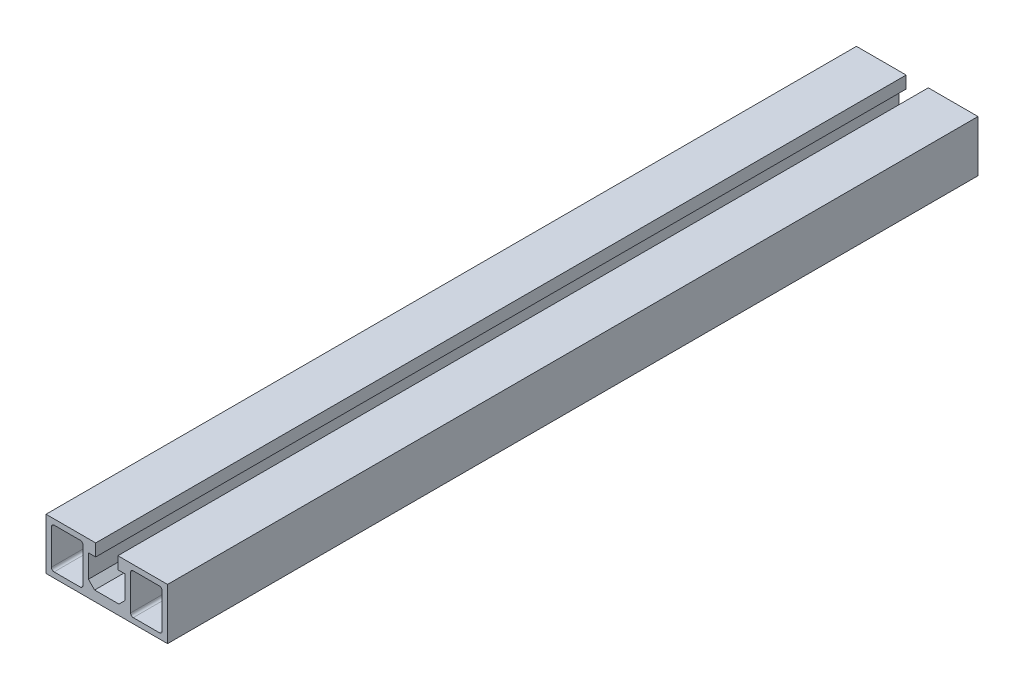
ISO-10303-21;
HEADER;
FILE_DESCRIPTION(('STEP AP214'),'2;1');
FILE_NAME('part.step','',(''),(''),'','','');
FILE_SCHEMA(('AUTOMOTIVE_DESIGN { 1 0 10303 214 1 1 1 1 }'));
ENDSEC;
DATA;
#1=APPLICATION_CONTEXT('core data for automotive mechanical design processes');
#2=APPLICATION_PROTOCOL_DEFINITION('international standard','automotive_design',2000,#1);
#3=PRODUCT_CONTEXT('',#1,'mechanical');
#4=PRODUCT('Part','Part','',(#3));
#5=PRODUCT_RELATED_PRODUCT_CATEGORY('part','',(#4));
#6=PRODUCT_DEFINITION_FORMATION('','',#4);
#7=PRODUCT_DEFINITION_CONTEXT('part definition',#1,'design');
#8=PRODUCT_DEFINITION('design','',#6,#7);
#9=PRODUCT_DEFINITION_SHAPE('','',#8);
#10=(LENGTH_UNIT() NAMED_UNIT(*) SI_UNIT(.MILLI.,.METRE.));
#11=(NAMED_UNIT(*) PLANE_ANGLE_UNIT() SI_UNIT($,.RADIAN.));
#12=(NAMED_UNIT(*) SI_UNIT($,.STERADIAN.) SOLID_ANGLE_UNIT());
#13=UNCERTAINTY_MEASURE_WITH_UNIT(LENGTH_MEASURE(1.E-05),#10,'distance_accuracy_value','');
#14=(GEOMETRIC_REPRESENTATION_CONTEXT(3) GLOBAL_UNCERTAINTY_ASSIGNED_CONTEXT((#13)) GLOBAL_UNIT_ASSIGNED_CONTEXT((#10,
#11,#12)) REPRESENTATION_CONTEXT('',''));
#15=CARTESIAN_POINT('',(0.,0.,0.));
#16=DIRECTION('',(0.,0.,1.));
#17=DIRECTION('',(1.,0.,0.));
#18=AXIS2_PLACEMENT_3D('',#15,#16,#17);
#19=CARTESIAN_POINT('',(-4.09999999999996,9.50000000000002,-150.));
#20=DIRECTION('',(0.,1.,0.));
#21=DIRECTION('',(-1.,0.,0.));
#22=AXIS2_PLACEMENT_3D('',#19,#20,#21);
#23=PLANE('',#22);
#24=DIRECTION('',(0.,0.,1.));
#25=VECTOR('',#24,1.);
#26=CARTESIAN_POINT('',(-22.5,9.50000000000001,-150.));
#27=LINE('',#26,#25);
#28=CARTESIAN_POINT('',(-22.5,9.50000000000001,-150.));
#29=VERTEX_POINT('',#28);
#30=CARTESIAN_POINT('',(-22.5,9.50000000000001,150.));
#31=VERTEX_POINT('',#30);
#32=EDGE_CURVE('E33',#29,#31,#27,.T.);
#33=ORIENTED_EDGE('',*,*,#32,.T.);
#34=DIRECTION('',(-1.,0.,0.));
#35=VECTOR('',#34,1.);
#36=CARTESIAN_POINT('',(-4.09999999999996,9.50000000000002,150.));
#37=LINE('',#36,#35);
#38=CARTESIAN_POINT('',(-4.09999999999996,9.50000000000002,150.));
#39=VERTEX_POINT('',#38);
#40=EDGE_CURVE('E294',#39,#31,#37,.T.);
#41=ORIENTED_EDGE('',*,*,#40,.F.);
#42=DIRECTION('',(0.,0.,1.));
#43=VECTOR('',#42,1.);
#44=CARTESIAN_POINT('',(-4.09999999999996,9.50000000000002,-150.));
#45=LINE('',#44,#43);
#46=CARTESIAN_POINT('',(-4.09999999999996,9.50000000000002,-150.));
#47=VERTEX_POINT('',#46);
#48=EDGE_CURVE('E11',#47,#39,#45,.T.);
#49=ORIENTED_EDGE('',*,*,#48,.F.);
#50=DIRECTION('',(-1.,0.,0.));
#51=VECTOR('',#50,1.);
#52=CARTESIAN_POINT('',(-4.09999999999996,9.50000000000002,-150.));
#53=LINE('',#52,#51);
#54=EDGE_CURVE('E391',#47,#29,#53,.T.);
#55=ORIENTED_EDGE('',*,*,#54,.T.);
#56=EDGE_LOOP('',(#33,#41,#49,#55));
#57=FACE_BOUND('',#56,.T.);
#58=ADVANCED_FACE('F30',(#57),#23,.T.);
#59=CARTESIAN_POINT('',(-4.09999999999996,4.99999999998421,-150.));
#60=DIRECTION('',(1.,0.,0.));
#61=DIRECTION('',(0.,0.,-1.));
#62=AXIS2_PLACEMENT_3D('',#59,#60,#61);
#63=PLANE('',#62);
#64=ORIENTED_EDGE('',*,*,#48,.T.);
#65=DIRECTION('',(0.,1.,0.));
#66=VECTOR('',#65,1.);
#67=CARTESIAN_POINT('',(-4.09999999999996,4.99999999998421,150.));
#68=LINE('',#67,#66);
#69=CARTESIAN_POINT('',(-4.09999999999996,4.99999999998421,150.));
#70=VERTEX_POINT('',#69);
#71=EDGE_CURVE('E333',#70,#39,#68,.T.);
#72=ORIENTED_EDGE('',*,*,#71,.F.);
#73=DIRECTION('',(0.,0.,1.));
#74=VECTOR('',#73,1.);
#75=CARTESIAN_POINT('',(-4.09999999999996,4.99999999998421,-150.));
#76=LINE('',#75,#74);
#77=CARTESIAN_POINT('',(-4.09999999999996,4.99999999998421,-150.));
#78=VERTEX_POINT('',#77);
#79=EDGE_CURVE('E38',#78,#70,#76,.T.);
#80=ORIENTED_EDGE('',*,*,#79,.F.);
#81=DIRECTION('',(0.,1.,0.));
#82=VECTOR('',#81,1.);
#83=CARTESIAN_POINT('',(-4.09999999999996,4.99999999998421,-150.));
#84=LINE('',#83,#82);
#85=EDGE_CURVE('E443',#78,#47,#84,.T.);
#86=ORIENTED_EDGE('',*,*,#85,.T.);
#87=EDGE_LOOP('',(#64,#72,#80,#86));
#88=FACE_BOUND('',#87,.T.);
#89=ADVANCED_FACE('F479',(#88),#63,.T.);
#90=CARTESIAN_POINT('',(-6.79999999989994,4.99999999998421,-150.));
#91=DIRECTION('',(0.,-1.,0.));
#92=DIRECTION('',(0.,0.,-1.));
#93=AXIS2_PLACEMENT_3D('',#90,#91,#92);
#94=PLANE('',#93);
#95=ORIENTED_EDGE('',*,*,#79,.T.);
#96=DIRECTION('',(1.,0.,0.));
#97=VECTOR('',#96,1.);
#98=CARTESIAN_POINT('',(-6.79999999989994,4.99999999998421,150.));
#99=LINE('',#98,#97);
#100=CARTESIAN_POINT('',(-6.79999999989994,4.99999999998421,150.));
#101=VERTEX_POINT('',#100);
#102=EDGE_CURVE('E330',#101,#70,#99,.T.);
#103=ORIENTED_EDGE('',*,*,#102,.F.);
#104=DIRECTION('',(0.,0.,1.));
#105=VECTOR('',#104,1.);
#106=CARTESIAN_POINT('',(-6.79999999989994,4.99999999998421,-150.));
#107=LINE('',#106,#105);
#108=CARTESIAN_POINT('',(-6.79999999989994,4.99999999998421,-150.));
#109=VERTEX_POINT('',#108);
#110=EDGE_CURVE('E447',#109,#101,#107,.T.);
#111=ORIENTED_EDGE('',*,*,#110,.F.);
#112=DIRECTION('',(1.,0.,0.));
#113=VECTOR('',#112,1.);
#114=CARTESIAN_POINT('',(-6.79999999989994,4.99999999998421,-150.));
#115=LINE('',#114,#113);
#116=EDGE_CURVE('E440',#109,#78,#115,.T.);
#117=ORIENTED_EDGE('',*,*,#116,.T.);
#118=EDGE_LOOP('',(#95,#103,#111,#117));
#119=FACE_BOUND('',#118,.T.);
#120=ADVANCED_FACE('F524',(#119),#94,.T.);
#121=CARTESIAN_POINT('',(-6.79999999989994,-3.4999999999,-150.));
#122=DIRECTION('',(1.,0.,0.));
#123=DIRECTION('',(0.,0.,-1.));
#124=AXIS2_PLACEMENT_3D('',#121,#122,#123);
#125=PLANE('',#124);
#126=ORIENTED_EDGE('',*,*,#110,.T.);
#127=DIRECTION('',(0.,1.,0.));
#128=VECTOR('',#127,1.);
#129=CARTESIAN_POINT('',(-6.79999999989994,-3.4999999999,150.));
#130=LINE('',#129,#128);
#131=CARTESIAN_POINT('',(-6.79999999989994,-3.4999999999,150.));
#132=VERTEX_POINT('',#131);
#133=EDGE_CURVE('E327',#132,#101,#130,.T.);
#134=ORIENTED_EDGE('',*,*,#133,.F.);
#135=DIRECTION('',(0.,0.,1.));
#136=VECTOR('',#135,1.);
#137=CARTESIAN_POINT('',(-6.79999999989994,-3.4999999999,-150.));
#138=LINE('',#137,#136);
#139=CARTESIAN_POINT('',(-6.79999999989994,-3.4999999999,-150.));
#140=VERTEX_POINT('',#139);
#141=EDGE_CURVE('E449',#140,#132,#138,.T.);
#142=ORIENTED_EDGE('',*,*,#141,.F.);
#143=DIRECTION('',(0.,1.,0.));
#144=VECTOR('',#143,1.);
#145=CARTESIAN_POINT('',(-6.79999999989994,-3.4999999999,-150.));
#146=LINE('',#145,#144);
#147=EDGE_CURVE('E437',#140,#109,#146,.T.);
#148=ORIENTED_EDGE('',*,*,#147,.T.);
#149=EDGE_LOOP('',(#126,#134,#142,#148));
#150=FACE_BOUND('',#149,.T.);
#151=ADVANCED_FACE('F521',(#150),#125,.T.);
#152=CARTESIAN_POINT('',(-4.49999999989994,-5.7999999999,-150.));
#153=DIRECTION('',(0.707106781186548,0.707106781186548,0.));
#154=DIRECTION('',(-0.707106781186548,0.707106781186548,0.));
#155=AXIS2_PLACEMENT_3D('',#152,#153,#154);
#156=PLANE('',#155);
#157=ORIENTED_EDGE('',*,*,#141,.T.);
#158=DIRECTION('',(-0.707106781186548,0.707106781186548,0.));
#159=VECTOR('',#158,1.);
#160=CARTESIAN_POINT('',(-4.49999999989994,-5.7999999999,150.));
#161=LINE('',#160,#159);
#162=CARTESIAN_POINT('',(-4.49999999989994,-5.7999999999,150.));
#163=VERTEX_POINT('',#162);
#164=EDGE_CURVE('E324',#163,#132,#161,.T.);
#165=ORIENTED_EDGE('',*,*,#164,.F.);
#166=DIRECTION('',(0.,0.,1.));
#167=VECTOR('',#166,1.);
#168=CARTESIAN_POINT('',(-4.49999999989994,-5.7999999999,-150.));
#169=LINE('',#168,#167);
#170=CARTESIAN_POINT('',(-4.49999999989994,-5.7999999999,-150.));
#171=VERTEX_POINT('',#170);
#172=EDGE_CURVE('E451',#171,#163,#169,.T.);
#173=ORIENTED_EDGE('',*,*,#172,.F.);
#174=DIRECTION('',(-0.707106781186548,0.707106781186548,0.));
#175=VECTOR('',#174,1.);
#176=CARTESIAN_POINT('',(-4.49999999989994,-5.7999999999,-150.));
#177=LINE('',#176,#175);
#178=EDGE_CURVE('E434',#171,#140,#177,.T.);
#179=ORIENTED_EDGE('',*,*,#178,.T.);
#180=EDGE_LOOP('',(#157,#165,#173,#179));
#181=FACE_BOUND('',#180,.T.);
#182=ADVANCED_FACE('F518',(#181),#156,.T.);
#183=CARTESIAN_POINT('',(4.50000000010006,-5.7999999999,-150.));
#184=DIRECTION('',(0.,1.,0.));
#185=DIRECTION('',(0.,0.,1.));
#186=AXIS2_PLACEMENT_3D('',#183,#184,#185);
#187=PLANE('',#186);
#188=ORIENTED_EDGE('',*,*,#172,.T.);
#189=DIRECTION('',(-1.,0.,0.));
#190=VECTOR('',#189,1.);
#191=CARTESIAN_POINT('',(4.50000000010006,-5.7999999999,150.));
#192=LINE('',#191,#190);
#193=CARTESIAN_POINT('',(4.50000000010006,-5.7999999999,150.));
#194=VERTEX_POINT('',#193);
#195=EDGE_CURVE('E321',#194,#163,#192,.T.);
#196=ORIENTED_EDGE('',*,*,#195,.F.);
#197=DIRECTION('',(0.,0.,1.));
#198=VECTOR('',#197,1.);
#199=CARTESIAN_POINT('',(4.50000000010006,-5.7999999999,-150.));
#200=LINE('',#199,#198);
#201=CARTESIAN_POINT('',(4.50000000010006,-5.7999999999,-150.));
#202=VERTEX_POINT('',#201);
#203=EDGE_CURVE('E453',#202,#194,#200,.T.);
#204=ORIENTED_EDGE('',*,*,#203,.F.);
#205=DIRECTION('',(-1.,0.,0.));
#206=VECTOR('',#205,1.);
#207=CARTESIAN_POINT('',(4.50000000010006,-5.7999999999,-150.));
#208=LINE('',#207,#206);
#209=EDGE_CURVE('E431',#202,#171,#208,.T.);
#210=ORIENTED_EDGE('',*,*,#209,.T.);
#211=EDGE_LOOP('',(#188,#196,#204,#210));
#212=FACE_BOUND('',#211,.T.);
#213=ADVANCED_FACE('F516',(#212),#187,.T.);
#214=CARTESIAN_POINT('',(6.80000000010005,-3.4999999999,-150.));
#215=DIRECTION('',(-0.707106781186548,0.707106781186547,0.));
#216=DIRECTION('',(-0.707106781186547,-0.707106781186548,0.));
#217=AXIS2_PLACEMENT_3D('',#214,#215,#216);
#218=PLANE('',#217);
#219=ORIENTED_EDGE('',*,*,#203,.T.);
#220=DIRECTION('',(-0.707106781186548,-0.707106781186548,0.));
#221=VECTOR('',#220,1.);
#222=CARTESIAN_POINT('',(6.80000000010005,-3.4999999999,150.));
#223=LINE('',#222,#221);
#224=CARTESIAN_POINT('',(6.80000000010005,-3.4999999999,150.));
#225=VERTEX_POINT('',#224);
#226=EDGE_CURVE('E318',#225,#194,#223,.T.);
#227=ORIENTED_EDGE('',*,*,#226,.F.);
#228=DIRECTION('',(0.,0.,1.));
#229=VECTOR('',#228,1.);
#230=CARTESIAN_POINT('',(6.80000000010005,-3.4999999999,-150.));
#231=LINE('',#230,#229);
#232=CARTESIAN_POINT('',(6.80000000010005,-3.4999999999,-150.));
#233=VERTEX_POINT('',#232);
#234=EDGE_CURVE('E455',#233,#225,#231,.T.);
#235=ORIENTED_EDGE('',*,*,#234,.F.);
#236=DIRECTION('',(-0.707106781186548,-0.707106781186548,0.));
#237=VECTOR('',#236,1.);
#238=CARTESIAN_POINT('',(6.80000000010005,-3.4999999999,-150.));
#239=LINE('',#238,#237);
#240=EDGE_CURVE('E428',#233,#202,#239,.T.);
#241=ORIENTED_EDGE('',*,*,#240,.T.);
#242=EDGE_LOOP('',(#219,#227,#235,#241));
#243=FACE_BOUND('',#242,.T.);
#244=ADVANCED_FACE('F511',(#243),#218,.T.);
#245=CARTESIAN_POINT('',(6.80000000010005,5.0000000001,-150.));
#246=DIRECTION('',(-1.,0.,0.));
#247=DIRECTION('',(0.,0.,1.));
#248=AXIS2_PLACEMENT_3D('',#245,#246,#247);
#249=PLANE('',#248);
#250=ORIENTED_EDGE('',*,*,#234,.T.);
#251=DIRECTION('',(0.,-1.,0.));
#252=VECTOR('',#251,1.);
#253=CARTESIAN_POINT('',(6.80000000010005,5.0000000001,150.));
#254=LINE('',#253,#252);
#255=CARTESIAN_POINT('',(6.80000000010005,5.0000000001,150.));
#256=VERTEX_POINT('',#255);
#257=EDGE_CURVE('E315',#256,#225,#254,.T.);
#258=ORIENTED_EDGE('',*,*,#257,.F.);
#259=DIRECTION('',(0.,0.,1.));
#260=VECTOR('',#259,1.);
#261=CARTESIAN_POINT('',(6.80000000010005,5.0000000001,-150.));
#262=LINE('',#261,#260);
#263=CARTESIAN_POINT('',(6.80000000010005,5.0000000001,-150.));
#264=VERTEX_POINT('',#263);
#265=EDGE_CURVE('E457',#264,#256,#262,.T.);
#266=ORIENTED_EDGE('',*,*,#265,.F.);
#267=DIRECTION('',(0.,-1.,0.));
#268=VECTOR('',#267,1.);
#269=CARTESIAN_POINT('',(6.80000000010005,5.0000000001,-150.));
#270=LINE('',#269,#268);
#271=EDGE_CURVE('E425',#264,#233,#270,.T.);
#272=ORIENTED_EDGE('',*,*,#271,.T.);
#273=EDGE_LOOP('',(#250,#258,#266,#272));
#274=FACE_BOUND('',#273,.T.);
#275=ADVANCED_FACE('F506',(#274),#249,.T.);
#276=CARTESIAN_POINT('',(4.10000000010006,5.0000000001,-150.));
#277=DIRECTION('',(0.,-1.,0.));
#278=DIRECTION('',(0.,0.,-1.));
#279=AXIS2_PLACEMENT_3D('',#276,#277,#278);
#280=PLANE('',#279);
#281=ORIENTED_EDGE('',*,*,#265,.T.);
#282=DIRECTION('',(1.,0.,0.));
#283=VECTOR('',#282,1.);
#284=CARTESIAN_POINT('',(4.10000000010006,5.0000000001,150.));
#285=LINE('',#284,#283);
#286=CARTESIAN_POINT('',(4.10000000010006,5.0000000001,150.));
#287=VERTEX_POINT('',#286);
#288=EDGE_CURVE('E312',#287,#256,#285,.T.);
#289=ORIENTED_EDGE('',*,*,#288,.F.);
#290=DIRECTION('',(0.,0.,1.));
#291=VECTOR('',#290,1.);
#292=CARTESIAN_POINT('',(4.10000000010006,5.0000000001,-150.));
#293=LINE('',#292,#291);
#294=CARTESIAN_POINT('',(4.10000000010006,5.0000000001,-150.));
#295=VERTEX_POINT('',#294);
#296=EDGE_CURVE('E459',#295,#287,#293,.T.);
#297=ORIENTED_EDGE('',*,*,#296,.F.);
#298=DIRECTION('',(1.,0.,0.));
#299=VECTOR('',#298,1.);
#300=CARTESIAN_POINT('',(4.10000000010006,5.0000000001,-150.));
#301=LINE('',#300,#299);
#302=EDGE_CURVE('E422',#295,#264,#301,.T.);
#303=ORIENTED_EDGE('',*,*,#302,.T.);
#304=EDGE_LOOP('',(#281,#289,#297,#303));
#305=FACE_BOUND('',#304,.T.);
#306=ADVANCED_FACE('F504',(#305),#280,.T.);
#307=CARTESIAN_POINT('',(4.10000000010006,9.50000000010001,-150.));
#308=DIRECTION('',(-1.,0.,0.));
#309=DIRECTION('',(0.,0.,1.));
#310=AXIS2_PLACEMENT_3D('',#307,#308,#309);
#311=PLANE('',#310);
#312=ORIENTED_EDGE('',*,*,#296,.T.);
#313=DIRECTION('',(0.,-1.,0.));
#314=VECTOR('',#313,1.);
#315=CARTESIAN_POINT('',(4.10000000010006,9.50000000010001,150.));
#316=LINE('',#315,#314);
#317=CARTESIAN_POINT('',(4.10000000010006,9.50000000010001,150.));
#318=VERTEX_POINT('',#317);
#319=EDGE_CURVE('E309',#318,#287,#316,.T.);
#320=ORIENTED_EDGE('',*,*,#319,.F.);
#321=DIRECTION('',(0.,0.,1.));
#322=VECTOR('',#321,1.);
#323=CARTESIAN_POINT('',(4.10000000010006,9.50000000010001,-150.));
#324=LINE('',#323,#322);
#325=CARTESIAN_POINT('',(4.10000000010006,9.50000000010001,-150.));
#326=VERTEX_POINT('',#325);
#327=EDGE_CURVE('E461',#326,#318,#324,.T.);
#328=ORIENTED_EDGE('',*,*,#327,.F.);
#329=DIRECTION('',(0.,-1.,0.));
#330=VECTOR('',#329,1.);
#331=CARTESIAN_POINT('',(4.10000000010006,9.50000000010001,-150.));
#332=LINE('',#331,#330);
#333=EDGE_CURVE('E419',#326,#295,#332,.T.);
#334=ORIENTED_EDGE('',*,*,#333,.T.);
#335=EDGE_LOOP('',(#312,#320,#328,#334));
#336=FACE_BOUND('',#335,.T.);
#337=ADVANCED_FACE('F499',(#336),#311,.T.);
#338=CARTESIAN_POINT('',(22.5,9.50000000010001,-150.));
#339=DIRECTION('',(0.,1.,0.));
#340=DIRECTION('',(0.,0.,1.));
#341=AXIS2_PLACEMENT_3D('',#338,#339,#340);
#342=PLANE('',#341);
#343=ORIENTED_EDGE('',*,*,#327,.T.);
#344=DIRECTION('',(-1.,0.,0.));
#345=VECTOR('',#344,1.);
#346=CARTESIAN_POINT('',(22.5,9.50000000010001,150.));
#347=LINE('',#346,#345);
#348=CARTESIAN_POINT('',(22.5,9.50000000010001,150.));
#349=VERTEX_POINT('',#348);
#350=EDGE_CURVE('E306',#349,#318,#347,.T.);
#351=ORIENTED_EDGE('',*,*,#350,.F.);
#352=DIRECTION('',(0.,0.,1.));
#353=VECTOR('',#352,1.);
#354=CARTESIAN_POINT('',(22.5,9.50000000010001,-150.));
#355=LINE('',#354,#353);
#356=CARTESIAN_POINT('',(22.5,9.50000000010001,-150.));
#357=VERTEX_POINT('',#356);
#358=EDGE_CURVE('E463',#357,#349,#355,.T.);
#359=ORIENTED_EDGE('',*,*,#358,.F.);
#360=DIRECTION('',(-1.,0.,0.));
#361=VECTOR('',#360,1.);
#362=CARTESIAN_POINT('',(22.5,9.50000000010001,-150.));
#363=LINE('',#362,#361);
#364=EDGE_CURVE('E416',#357,#326,#363,.T.);
#365=ORIENTED_EDGE('',*,*,#364,.T.);
#366=EDGE_LOOP('',(#343,#351,#359,#365));
#367=FACE_BOUND('',#366,.T.);
#368=ADVANCED_FACE('F494',(#367),#342,.T.);
#369=CARTESIAN_POINT('',(22.5,-9.5,-150.));
#370=DIRECTION('',(1.,0.,0.));
#371=DIRECTION('',(0.,0.,-1.));
#372=AXIS2_PLACEMENT_3D('',#369,#370,#371);
#373=PLANE('',#372);
#374=ORIENTED_EDGE('',*,*,#358,.T.);
#375=DIRECTION('',(0.,1.,0.));
#376=VECTOR('',#375,1.);
#377=CARTESIAN_POINT('',(22.5,-9.5,150.));
#378=LINE('',#377,#376);
#379=CARTESIAN_POINT('',(22.5,-9.5,150.));
#380=VERTEX_POINT('',#379);
#381=EDGE_CURVE('E303',#380,#349,#378,.T.);
#382=ORIENTED_EDGE('',*,*,#381,.F.);
#383=DIRECTION('',(0.,0.,1.));
#384=VECTOR('',#383,1.);
#385=CARTESIAN_POINT('',(22.5,-9.5,-150.));
#386=LINE('',#385,#384);
#387=CARTESIAN_POINT('',(22.5,-9.5,-150.));
#388=VERTEX_POINT('',#387);
#389=EDGE_CURVE('E465',#388,#380,#386,.T.);
#390=ORIENTED_EDGE('',*,*,#389,.F.);
#391=DIRECTION('',(0.,1.,0.));
#392=VECTOR('',#391,1.);
#393=CARTESIAN_POINT('',(22.5,-9.5,-150.));
#394=LINE('',#393,#392);
#395=EDGE_CURVE('E413',#388,#357,#394,.T.);
#396=ORIENTED_EDGE('',*,*,#395,.T.);
#397=EDGE_LOOP('',(#374,#382,#390,#396));
#398=FACE_BOUND('',#397,.T.);
#399=ADVANCED_FACE('F492',(#398),#373,.T.);
#400=CARTESIAN_POINT('',(-22.5,-9.5,-150.));
#401=DIRECTION('',(0.,-1.,0.));
#402=DIRECTION('',(0.,0.,-1.));
#403=AXIS2_PLACEMENT_3D('',#400,#401,#402);
#404=PLANE('',#403);
#405=ORIENTED_EDGE('',*,*,#389,.T.);
#406=DIRECTION('',(1.,0.,0.));
#407=VECTOR('',#406,1.);
#408=CARTESIAN_POINT('',(-22.5,-9.5,150.));
#409=LINE('',#408,#407);
#410=CARTESIAN_POINT('',(-22.5,-9.5,150.));
#411=VERTEX_POINT('',#410);
#412=EDGE_CURVE('E300',#411,#380,#409,.T.);
#413=ORIENTED_EDGE('',*,*,#412,.F.);
#414=DIRECTION('',(0.,0.,1.));
#415=VECTOR('',#414,1.);
#416=CARTESIAN_POINT('',(-22.5,-9.5,-150.));
#417=LINE('',#416,#415);
#418=CARTESIAN_POINT('',(-22.5,-9.5,-150.));
#419=VERTEX_POINT('',#418);
#420=EDGE_CURVE('E466',#419,#411,#417,.T.);
#421=ORIENTED_EDGE('',*,*,#420,.F.);
#422=DIRECTION('',(1.,0.,0.));
#423=VECTOR('',#422,1.);
#424=CARTESIAN_POINT('',(-22.5,-9.5,-150.));
#425=LINE('',#424,#423);
#426=EDGE_CURVE('E410',#419,#388,#425,.T.);
#427=ORIENTED_EDGE('',*,*,#426,.T.);
#428=EDGE_LOOP('',(#405,#413,#421,#427));
#429=FACE_BOUND('',#428,.T.);
#430=ADVANCED_FACE('F488',(#429),#404,.T.);
#431=CARTESIAN_POINT('',(-22.5,9.50000000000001,-150.));
#432=DIRECTION('',(-1.,0.,0.));
#433=DIRECTION('',(0.,0.,1.));
#434=AXIS2_PLACEMENT_3D('',#431,#432,#433);
#435=PLANE('',#434);
#436=ORIENTED_EDGE('',*,*,#420,.T.);
#437=DIRECTION('',(0.,-1.,0.));
#438=VECTOR('',#437,1.);
#439=CARTESIAN_POINT('',(-22.5,9.50000000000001,150.));
#440=LINE('',#439,#438);
#441=EDGE_CURVE('E297',#31,#411,#440,.T.);
#442=ORIENTED_EDGE('',*,*,#441,.F.);
#443=ORIENTED_EDGE('',*,*,#32,.F.);
#444=DIRECTION('',(0.,-1.,0.));
#445=VECTOR('',#444,1.);
#446=CARTESIAN_POINT('',(-22.5,9.50000000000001,-150.));
#447=LINE('',#446,#445);
#448=EDGE_CURVE('E407',#29,#419,#447,.T.);
#449=ORIENTED_EDGE('',*,*,#448,.T.);
#450=EDGE_LOOP('',(#436,#442,#443,#449));
#451=FACE_BOUND('',#450,.T.);
#452=ADVANCED_FACE('F473',(#451),#435,.T.);
#453=CARTESIAN_POINT('',(-22.5,9.50000000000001,-150.));
#454=DIRECTION('',(0.,0.,1.));
#455=DIRECTION('',(1.,0.,0.));
#456=AXIS2_PLACEMENT_3D('',#453,#454,#455);
#457=PLANE('',#456);
#458=DIRECTION('',(1.,0.,0.));
#459=VECTOR('',#458,1.);
#460=CARTESIAN_POINT('',(-9.79999999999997,-7.5,-150.));
#461=LINE('',#460,#459);
#462=CARTESIAN_POINT('',(-19.5,-7.5,-150.));
#463=VERTEX_POINT('',#462);
#464=CARTESIAN_POINT('',(-9.79999999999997,-7.5,-150.));
#465=VERTEX_POINT('',#464);
#466=EDGE_CURVE('E239',#463,#465,#461,.T.);
#467=ORIENTED_EDGE('',*,*,#466,.T.);
#468=CARTESIAN_POINT('',(-9.79999999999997,-6.49999999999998,-150.));
#469=DIRECTION('',(0.,0.,1.));
#470=DIRECTION('',(1.,0.,0.));
#471=AXIS2_PLACEMENT_3D('',#468,#469,#470);
#472=CIRCLE('',#471,1.);
#473=CARTESIAN_POINT('',(-8.79999999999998,-6.49999999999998,-150.));
#474=VERTEX_POINT('',#473);
#475=EDGE_CURVE('E336',#465,#474,#472,.T.);
#476=ORIENTED_EDGE('',*,*,#475,.T.);
#477=DIRECTION('',(0.,1.,0.));
#478=VECTOR('',#477,1.);
#479=CARTESIAN_POINT('',(-8.79999999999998,6.50000000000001,-150.));
#480=LINE('',#479,#478);
#481=CARTESIAN_POINT('',(-8.79999999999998,6.50000000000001,-150.));
#482=VERTEX_POINT('',#481);
#483=EDGE_CURVE('E234',#474,#482,#480,.T.);
#484=ORIENTED_EDGE('',*,*,#483,.T.);
#485=CARTESIAN_POINT('',(-9.79999999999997,6.50000000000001,-150.));
#486=DIRECTION('',(0.,0.,1.));
#487=DIRECTION('',(1.,0.,0.));
#488=AXIS2_PLACEMENT_3D('',#485,#486,#487);
#489=CIRCLE('',#488,0.999999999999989);
#490=CARTESIAN_POINT('',(-9.79999999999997,7.5,-150.));
#491=VERTEX_POINT('',#490);
#492=EDGE_CURVE('E46',#482,#491,#489,.T.);
#493=ORIENTED_EDGE('',*,*,#492,.T.);
#494=DIRECTION('',(-1.,0.,0.));
#495=VECTOR('',#494,1.);
#496=CARTESIAN_POINT('',(-19.5,7.5,-150.));
#497=LINE('',#496,#495);
#498=CARTESIAN_POINT('',(-19.5,7.5,-150.));
#499=VERTEX_POINT('',#498);
#500=EDGE_CURVE('E340',#491,#499,#497,.T.);
#501=ORIENTED_EDGE('',*,*,#500,.T.);
#502=CARTESIAN_POINT('',(-19.5,6.50000000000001,-150.));
#503=DIRECTION('',(0.,0.,1.));
#504=DIRECTION('',(1.,0.,0.));
#505=AXIS2_PLACEMENT_3D('',#502,#503,#504);
#506=CIRCLE('',#505,0.99999999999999);
#507=CARTESIAN_POINT('',(-20.5,6.50000000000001,-150.));
#508=VERTEX_POINT('',#507);
#509=EDGE_CURVE('E343',#499,#508,#506,.T.);
#510=ORIENTED_EDGE('',*,*,#509,.T.);
#511=DIRECTION('',(0.,-1.,0.));
#512=VECTOR('',#511,1.);
#513=CARTESIAN_POINT('',(-20.5,-6.49999999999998,-150.));
#514=LINE('',#513,#512);
#515=CARTESIAN_POINT('',(-20.5,-6.49999999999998,-150.));
#516=VERTEX_POINT('',#515);
#517=EDGE_CURVE('E346',#508,#516,#514,.T.);
#518=ORIENTED_EDGE('',*,*,#517,.T.);
#519=CARTESIAN_POINT('',(-19.5,-6.49999999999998,-150.));
#520=DIRECTION('',(0.,0.,1.));
#521=DIRECTION('',(1.,0.,0.));
#522=AXIS2_PLACEMENT_3D('',#519,#520,#521);
#523=CIRCLE('',#522,1.);
#524=EDGE_CURVE('E349',#516,#463,#523,.T.);
#525=ORIENTED_EDGE('',*,*,#524,.T.);
#526=EDGE_LOOP('',(#467,#476,#484,#493,#501,#510,#518,#525));
#527=FACE_BOUND('',#526,.T.);
#528=DIRECTION('',(1.,0.,0.));
#529=VECTOR('',#528,1.);
#530=CARTESIAN_POINT('',(19.5,-7.49999999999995,-150.));
#531=LINE('',#530,#529);
#532=CARTESIAN_POINT('',(9.80000000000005,-7.49999999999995,-150.));
#533=VERTEX_POINT('',#532);
#534=CARTESIAN_POINT('',(19.5,-7.49999999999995,-150.));
#535=VERTEX_POINT('',#534);
#536=EDGE_CURVE('E385',#533,#535,#531,.T.);
#537=ORIENTED_EDGE('',*,*,#536,.T.);
#538=CARTESIAN_POINT('',(19.5,-6.49999999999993,-150.));
#539=DIRECTION('',(0.,0.,1.));
#540=DIRECTION('',(1.,0.,0.));
#541=AXIS2_PLACEMENT_3D('',#538,#539,#540);
#542=CIRCLE('',#541,1.);
#543=CARTESIAN_POINT('',(20.5,-6.49999999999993,-150.));
#544=VERTEX_POINT('',#543);
#545=EDGE_CURVE('E355',#535,#544,#542,.T.);
#546=ORIENTED_EDGE('',*,*,#545,.T.);
#547=DIRECTION('',(0.,1.,0.));
#548=VECTOR('',#547,1.);
#549=CARTESIAN_POINT('',(20.5,6.50000000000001,-150.));
#550=LINE('',#549,#548);
#551=CARTESIAN_POINT('',(20.5,6.50000000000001,-150.));
#552=VERTEX_POINT('',#551);
#553=EDGE_CURVE('E369',#544,#552,#550,.T.);
#554=ORIENTED_EDGE('',*,*,#553,.T.);
#555=CARTESIAN_POINT('',(19.5,6.50000000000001,-150.));
#556=DIRECTION('',(0.,0.,1.));
#557=DIRECTION('',(1.,0.,0.));
#558=AXIS2_PLACEMENT_3D('',#555,#556,#557);
#559=CIRCLE('',#558,0.99999999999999);
#560=CARTESIAN_POINT('',(19.5,7.5,-150.));
#561=VERTEX_POINT('',#560);
#562=EDGE_CURVE('E54',#552,#561,#559,.T.);
#563=ORIENTED_EDGE('',*,*,#562,.T.);
#564=DIRECTION('',(-1.,0.,0.));
#565=VECTOR('',#564,1.);
#566=CARTESIAN_POINT('',(9.80000000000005,7.5,-150.));
#567=LINE('',#566,#565);
#568=CARTESIAN_POINT('',(9.80000000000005,7.50000000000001,-150.));
#569=VERTEX_POINT('',#568);
#570=EDGE_CURVE('E373',#561,#569,#567,.T.);
#571=ORIENTED_EDGE('',*,*,#570,.T.);
#572=CARTESIAN_POINT('',(9.80000000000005,6.50000000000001,-150.));
#573=DIRECTION('',(0.,0.,1.));
#574=DIRECTION('',(1.,0.,0.));
#575=AXIS2_PLACEMENT_3D('',#572,#573,#574);
#576=CIRCLE('',#575,1.);
#577=CARTESIAN_POINT('',(8.80000000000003,6.50000000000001,-150.));
#578=VERTEX_POINT('',#577);
#579=EDGE_CURVE('E376',#569,#578,#576,.T.);
#580=ORIENTED_EDGE('',*,*,#579,.T.);
#581=DIRECTION('',(0.,-1.,0.));
#582=VECTOR('',#581,1.);
#583=CARTESIAN_POINT('',(8.80000000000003,-6.49999999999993,-150.));
#584=LINE('',#583,#582);
#585=CARTESIAN_POINT('',(8.80000000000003,-6.49999999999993,-150.));
#586=VERTEX_POINT('',#585);
#587=EDGE_CURVE('E379',#578,#586,#584,.T.);
#588=ORIENTED_EDGE('',*,*,#587,.T.);
#589=CARTESIAN_POINT('',(9.80000000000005,-6.49999999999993,-150.));
#590=DIRECTION('',(0.,0.,1.));
#591=DIRECTION('',(1.,0.,0.));
#592=AXIS2_PLACEMENT_3D('',#589,#590,#591);
#593=CIRCLE('',#592,1.00000000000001);
#594=EDGE_CURVE('E382',#586,#533,#593,.T.);
#595=ORIENTED_EDGE('',*,*,#594,.T.);
#596=EDGE_LOOP('',(#537,#546,#554,#563,#571,#580,#588,#595));
#597=FACE_BOUND('',#596,.T.);
#598=ORIENTED_EDGE('',*,*,#54,.F.);
#599=ORIENTED_EDGE('',*,*,#85,.F.);
#600=ORIENTED_EDGE('',*,*,#116,.F.);
#601=ORIENTED_EDGE('',*,*,#147,.F.);
#602=ORIENTED_EDGE('',*,*,#178,.F.);
#603=ORIENTED_EDGE('',*,*,#209,.F.);
#604=ORIENTED_EDGE('',*,*,#240,.F.);
#605=ORIENTED_EDGE('',*,*,#271,.F.);
#606=ORIENTED_EDGE('',*,*,#302,.F.);
#607=ORIENTED_EDGE('',*,*,#333,.F.);
#608=ORIENTED_EDGE('',*,*,#364,.F.);
#609=ORIENTED_EDGE('',*,*,#395,.F.);
#610=ORIENTED_EDGE('',*,*,#426,.F.);
#611=ORIENTED_EDGE('',*,*,#448,.F.);
#612=EDGE_LOOP('',(#598,#599,#600,#601,#602,#603,#604,#605,#606,#607,#608,#609,#610,#611));
#613=FACE_BOUND('',#612,.T.);
#614=ADVANCED_FACE('F482',(#527,#597,#613),#457,.F.);
#615=CARTESIAN_POINT('',(19.5,-6.49999999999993,-150.));
#616=DIRECTION('',(0.,0.,1.));
#617=DIRECTION('',(1.,0.,0.));
#618=AXIS2_PLACEMENT_3D('',#615,#616,#617);
#619=CYLINDRICAL_SURFACE('',#618,1.);
#620=DIRECTION('',(0.,0.,1.));
#621=VECTOR('',#620,1.);
#622=CARTESIAN_POINT('',(19.5,-7.49999999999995,-150.));
#623=LINE('',#622,#621);
#624=CARTESIAN_POINT('',(19.5,-7.49999999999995,150.));
#625=VERTEX_POINT('',#624);
#626=EDGE_CURVE('E389',#535,#625,#623,.T.);
#627=ORIENTED_EDGE('',*,*,#626,.T.);
#628=CARTESIAN_POINT('',(19.5,-6.49999999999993,150.));
#629=DIRECTION('',(0.,0.,1.));
#630=DIRECTION('',(1.,0.,0.));
#631=AXIS2_PLACEMENT_3D('',#628,#629,#630);
#632=CIRCLE('',#631,1.);
#633=CARTESIAN_POINT('',(20.5,-6.49999999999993,150.));
#634=VERTEX_POINT('',#633);
#635=EDGE_CURVE('E270',#625,#634,#632,.T.);
#636=ORIENTED_EDGE('',*,*,#635,.T.);
#637=DIRECTION('',(0.,0.,1.));
#638=VECTOR('',#637,1.);
#639=CARTESIAN_POINT('',(20.5,-6.49999999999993,-150.));
#640=LINE('',#639,#638);
#641=EDGE_CURVE('E388',#544,#634,#640,.T.);
#642=ORIENTED_EDGE('',*,*,#641,.F.);
#643=ORIENTED_EDGE('',*,*,#545,.F.);
#644=EDGE_LOOP('',(#627,#636,#642,#643));
#645=FACE_BOUND('',#644,.T.);
#646=ADVANCED_FACE('F638',(#645),#619,.F.);
#647=CARTESIAN_POINT('',(19.5,-7.49999999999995,-150.));
#648=DIRECTION('',(0.,-1.,0.));
#649=DIRECTION('',(0.,0.,-1.));
#650=AXIS2_PLACEMENT_3D('',#647,#648,#649);
#651=PLANE('',#650);
#652=DIRECTION('',(0.,0.,1.));
#653=VECTOR('',#652,1.);
#654=CARTESIAN_POINT('',(9.80000000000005,-7.49999999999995,-150.));
#655=LINE('',#654,#653);
#656=CARTESIAN_POINT('',(9.80000000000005,-7.49999999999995,150.));
#657=VERTEX_POINT('',#656);
#658=EDGE_CURVE('E392',#533,#657,#655,.T.);
#659=ORIENTED_EDGE('',*,*,#658,.T.);
#660=DIRECTION('',(1.,0.,0.));
#661=VECTOR('',#660,1.);
#662=CARTESIAN_POINT('',(19.5,-7.49999999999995,150.));
#663=LINE('',#662,#661);
#664=EDGE_CURVE('E291',#657,#625,#663,.T.);
#665=ORIENTED_EDGE('',*,*,#664,.T.);
#666=ORIENTED_EDGE('',*,*,#626,.F.);
#667=ORIENTED_EDGE('',*,*,#536,.F.);
#668=EDGE_LOOP('',(#659,#665,#666,#667));
#669=FACE_BOUND('',#668,.T.);
#670=ADVANCED_FACE('F648',(#669),#651,.F.);
#671=CARTESIAN_POINT('',(9.80000000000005,-6.49999999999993,-150.));
#672=DIRECTION('',(0.,0.,1.));
#673=DIRECTION('',(1.,0.,0.));
#674=AXIS2_PLACEMENT_3D('',#671,#672,#673);
#675=CYLINDRICAL_SURFACE('',#674,1.00000000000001);
#676=DIRECTION('',(0.,0.,1.));
#677=VECTOR('',#676,1.);
#678=CARTESIAN_POINT('',(8.80000000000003,-6.49999999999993,-150.));
#679=LINE('',#678,#677);
#680=CARTESIAN_POINT('',(8.80000000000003,-6.49999999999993,150.));
#681=VERTEX_POINT('',#680);
#682=EDGE_CURVE('E394',#586,#681,#679,.T.);
#683=ORIENTED_EDGE('',*,*,#682,.T.);
#684=CARTESIAN_POINT('',(9.80000000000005,-6.49999999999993,150.));
#685=DIRECTION('',(0.,0.,1.));
#686=DIRECTION('',(1.,0.,0.));
#687=AXIS2_PLACEMENT_3D('',#684,#685,#686);
#688=CIRCLE('',#687,1.00000000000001);
#689=EDGE_CURVE('E288',#681,#657,#688,.T.);
#690=ORIENTED_EDGE('',*,*,#689,.T.);
#691=ORIENTED_EDGE('',*,*,#658,.F.);
#692=ORIENTED_EDGE('',*,*,#594,.F.);
#693=EDGE_LOOP('',(#683,#690,#691,#692));
#694=FACE_BOUND('',#693,.T.);
#695=ADVANCED_FACE('F658',(#694),#675,.F.);
#696=CARTESIAN_POINT('',(8.80000000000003,-6.49999999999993,-150.));
#697=DIRECTION('',(-1.,0.,0.));
#698=DIRECTION('',(0.,0.,1.));
#699=AXIS2_PLACEMENT_3D('',#696,#697,#698);
#700=PLANE('',#699);
#701=DIRECTION('',(0.,0.,1.));
#702=VECTOR('',#701,1.);
#703=CARTESIAN_POINT('',(8.80000000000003,6.50000000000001,-150.));
#704=LINE('',#703,#702);
#705=CARTESIAN_POINT('',(8.80000000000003,6.50000000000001,150.));
#706=VERTEX_POINT('',#705);
#707=EDGE_CURVE('E396',#578,#706,#704,.T.);
#708=ORIENTED_EDGE('',*,*,#707,.T.);
#709=DIRECTION('',(0.,-1.,0.));
#710=VECTOR('',#709,1.);
#711=CARTESIAN_POINT('',(8.80000000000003,-6.49999999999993,150.));
#712=LINE('',#711,#710);
#713=EDGE_CURVE('E285',#706,#681,#712,.T.);
#714=ORIENTED_EDGE('',*,*,#713,.T.);
#715=ORIENTED_EDGE('',*,*,#682,.F.);
#716=ORIENTED_EDGE('',*,*,#587,.F.);
#717=EDGE_LOOP('',(#708,#714,#715,#716));
#718=FACE_BOUND('',#717,.T.);
#719=ADVANCED_FACE('F668',(#718),#700,.F.);
#720=CARTESIAN_POINT('',(9.80000000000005,6.50000000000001,-150.));
#721=DIRECTION('',(0.,0.,1.));
#722=DIRECTION('',(1.,0.,0.));
#723=AXIS2_PLACEMENT_3D('',#720,#721,#722);
#724=CYLINDRICAL_SURFACE('',#723,1.);
#725=DIRECTION('',(0.,0.,1.));
#726=VECTOR('',#725,1.);
#727=CARTESIAN_POINT('',(9.80000000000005,7.50000000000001,-150.));
#728=LINE('',#727,#726);
#729=CARTESIAN_POINT('',(9.80000000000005,7.50000000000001,150.));
#730=VERTEX_POINT('',#729);
#731=EDGE_CURVE('E398',#569,#730,#728,.T.);
#732=ORIENTED_EDGE('',*,*,#731,.T.);
#733=CARTESIAN_POINT('',(9.80000000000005,6.50000000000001,150.));
#734=DIRECTION('',(0.,0.,1.));
#735=DIRECTION('',(1.,0.,0.));
#736=AXIS2_PLACEMENT_3D('',#733,#734,#735);
#737=CIRCLE('',#736,1.);
#738=EDGE_CURVE('E282',#730,#706,#737,.T.);
#739=ORIENTED_EDGE('',*,*,#738,.T.);
#740=ORIENTED_EDGE('',*,*,#707,.F.);
#741=ORIENTED_EDGE('',*,*,#579,.F.);
#742=EDGE_LOOP('',(#732,#739,#740,#741));
#743=FACE_BOUND('',#742,.T.);
#744=ADVANCED_FACE('F678',(#743),#724,.F.);
#745=CARTESIAN_POINT('',(9.80000000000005,7.5,-150.));
#746=DIRECTION('',(0.,1.,0.));
#747=DIRECTION('',(0.,0.,1.));
#748=AXIS2_PLACEMENT_3D('',#745,#746,#747);
#749=PLANE('',#748);
#750=DIRECTION('',(0.,0.,1.));
#751=VECTOR('',#750,1.);
#752=CARTESIAN_POINT('',(19.5,7.5,-150.));
#753=LINE('',#752,#751);
#754=CARTESIAN_POINT('',(19.5,7.5,150.));
#755=VERTEX_POINT('',#754);
#756=EDGE_CURVE('E400',#561,#755,#753,.T.);
#757=ORIENTED_EDGE('',*,*,#756,.T.);
#758=DIRECTION('',(-1.,0.,0.));
#759=VECTOR('',#758,1.);
#760=CARTESIAN_POINT('',(9.80000000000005,7.5,150.));
#761=LINE('',#760,#759);
#762=EDGE_CURVE('E279',#755,#730,#761,.T.);
#763=ORIENTED_EDGE('',*,*,#762,.T.);
#764=ORIENTED_EDGE('',*,*,#731,.F.);
#765=ORIENTED_EDGE('',*,*,#570,.F.);
#766=EDGE_LOOP('',(#757,#763,#764,#765));
#767=FACE_BOUND('',#766,.T.);
#768=ADVANCED_FACE('F688',(#767),#749,.F.);
#769=CARTESIAN_POINT('',(19.5,6.50000000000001,-150.));
#770=DIRECTION('',(0.,0.,1.));
#771=DIRECTION('',(1.,0.,0.));
#772=AXIS2_PLACEMENT_3D('',#769,#770,#771);
#773=CYLINDRICAL_SURFACE('',#772,0.99999999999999);
#774=DIRECTION('',(0.,0.,1.));
#775=VECTOR('',#774,1.);
#776=CARTESIAN_POINT('',(20.5,6.50000000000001,-150.));
#777=LINE('',#776,#775);
#778=CARTESIAN_POINT('',(20.5,6.50000000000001,150.));
#779=VERTEX_POINT('',#778);
#780=EDGE_CURVE('E402',#552,#779,#777,.T.);
#781=ORIENTED_EDGE('',*,*,#780,.T.);
#782=CARTESIAN_POINT('',(19.5,6.50000000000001,150.));
#783=DIRECTION('',(0.,0.,1.));
#784=DIRECTION('',(1.,0.,0.));
#785=AXIS2_PLACEMENT_3D('',#782,#783,#784);
#786=CIRCLE('',#785,0.99999999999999);
#787=EDGE_CURVE('E276',#779,#755,#786,.T.);
#788=ORIENTED_EDGE('',*,*,#787,.T.);
#789=ORIENTED_EDGE('',*,*,#756,.F.);
#790=ORIENTED_EDGE('',*,*,#562,.F.);
#791=EDGE_LOOP('',(#781,#788,#789,#790));
#792=FACE_BOUND('',#791,.T.);
#793=ADVANCED_FACE('F698',(#792),#773,.F.);
#794=CARTESIAN_POINT('',(20.5,6.50000000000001,-150.));
#795=DIRECTION('',(1.,0.,0.));
#796=DIRECTION('',(0.,0.,-1.));
#797=AXIS2_PLACEMENT_3D('',#794,#795,#796);
#798=PLANE('',#797);
#799=ORIENTED_EDGE('',*,*,#641,.T.);
#800=DIRECTION('',(0.,1.,0.));
#801=VECTOR('',#800,1.);
#802=CARTESIAN_POINT('',(20.5,6.50000000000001,150.));
#803=LINE('',#802,#801);
#804=EDGE_CURVE('E273',#634,#779,#803,.T.);
#805=ORIENTED_EDGE('',*,*,#804,.T.);
#806=ORIENTED_EDGE('',*,*,#780,.F.);
#807=ORIENTED_EDGE('',*,*,#553,.F.);
#808=EDGE_LOOP('',(#799,#805,#806,#807));
#809=FACE_BOUND('',#808,.T.);
#810=ADVANCED_FACE('F708',(#809),#798,.F.);
#811=CARTESIAN_POINT('',(-9.79999999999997,-6.49999999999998,-150.));
#812=DIRECTION('',(0.,0.,1.));
#813=DIRECTION('',(1.,0.,0.));
#814=AXIS2_PLACEMENT_3D('',#811,#812,#813);
#815=CYLINDRICAL_SURFACE('',#814,1.);
#816=DIRECTION('',(0.,0.,1.));
#817=VECTOR('',#816,1.);
#818=CARTESIAN_POINT('',(-9.79999999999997,-7.5,-150.));
#819=LINE('',#818,#817);
#820=CARTESIAN_POINT('',(-9.79999999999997,-7.5,150.));
#821=VERTEX_POINT('',#820);
#822=EDGE_CURVE('E244',#465,#821,#819,.T.);
#823=ORIENTED_EDGE('',*,*,#822,.T.);
#824=CARTESIAN_POINT('',(-9.79999999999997,-6.49999999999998,150.));
#825=DIRECTION('',(0.,0.,1.));
#826=DIRECTION('',(1.,0.,0.));
#827=AXIS2_PLACEMENT_3D('',#824,#825,#826);
#828=CIRCLE('',#827,1.);
#829=CARTESIAN_POINT('',(-8.79999999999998,-6.49999999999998,150.));
#830=VERTEX_POINT('',#829);
#831=EDGE_CURVE('E242',#821,#830,#828,.T.);
#832=ORIENTED_EDGE('',*,*,#831,.T.);
#833=DIRECTION('',(0.,0.,1.));
#834=VECTOR('',#833,1.);
#835=CARTESIAN_POINT('',(-8.79999999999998,-6.49999999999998,-150.));
#836=LINE('',#835,#834);
#837=EDGE_CURVE('E227',#474,#830,#836,.T.);
#838=ORIENTED_EDGE('',*,*,#837,.F.);
#839=ORIENTED_EDGE('',*,*,#475,.F.);
#840=EDGE_LOOP('',(#823,#832,#838,#839));
#841=FACE_BOUND('',#840,.T.);
#842=ADVANCED_FACE('F243',(#841),#815,.F.);
#843=CARTESIAN_POINT('',(-9.79999999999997,-7.5,-150.));
#844=DIRECTION('',(0.,-1.,0.));
#845=DIRECTION('',(0.,0.,-1.));
#846=AXIS2_PLACEMENT_3D('',#843,#844,#845);
#847=PLANE('',#846);
#848=DIRECTION('',(0.,0.,1.));
#849=VECTOR('',#848,1.);
#850=CARTESIAN_POINT('',(-19.5,-7.5,-150.));
#851=LINE('',#850,#849);
#852=CARTESIAN_POINT('',(-19.5,-7.5,150.));
#853=VERTEX_POINT('',#852);
#854=EDGE_CURVE('E356',#463,#853,#851,.T.);
#855=ORIENTED_EDGE('',*,*,#854,.T.);
#856=DIRECTION('',(1.,0.,0.));
#857=VECTOR('',#856,1.);
#858=CARTESIAN_POINT('',(-9.79999999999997,-7.5,150.));
#859=LINE('',#858,#857);
#860=EDGE_CURVE('E268',#853,#821,#859,.T.);
#861=ORIENTED_EDGE('',*,*,#860,.T.);
#862=ORIENTED_EDGE('',*,*,#822,.F.);
#863=ORIENTED_EDGE('',*,*,#466,.F.);
#864=EDGE_LOOP('',(#855,#861,#862,#863));
#865=FACE_BOUND('',#864,.T.);
#866=ADVANCED_FACE('F726',(#865),#847,.F.);
#867=CARTESIAN_POINT('',(-19.5,-6.49999999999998,-150.));
#868=DIRECTION('',(0.,0.,1.));
#869=DIRECTION('',(1.,0.,0.));
#870=AXIS2_PLACEMENT_3D('',#867,#868,#869);
#871=CYLINDRICAL_SURFACE('',#870,1.);
#872=DIRECTION('',(0.,0.,1.));
#873=VECTOR('',#872,1.);
#874=CARTESIAN_POINT('',(-20.5,-6.49999999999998,-150.));
#875=LINE('',#874,#873);
#876=CARTESIAN_POINT('',(-20.5,-6.49999999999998,150.));
#877=VERTEX_POINT('',#876);
#878=EDGE_CURVE('E358',#516,#877,#875,.T.);
#879=ORIENTED_EDGE('',*,*,#878,.T.);
#880=CARTESIAN_POINT('',(-19.5,-6.49999999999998,150.));
#881=DIRECTION('',(0.,0.,1.));
#882=DIRECTION('',(1.,0.,0.));
#883=AXIS2_PLACEMENT_3D('',#880,#881,#882);
#884=CIRCLE('',#883,1.);
#885=EDGE_CURVE('E265',#877,#853,#884,.T.);
#886=ORIENTED_EDGE('',*,*,#885,.T.);
#887=ORIENTED_EDGE('',*,*,#854,.F.);
#888=ORIENTED_EDGE('',*,*,#524,.F.);
#889=EDGE_LOOP('',(#879,#886,#887,#888));
#890=FACE_BOUND('',#889,.T.);
#891=ADVANCED_FACE('F735',(#890),#871,.F.);
#892=CARTESIAN_POINT('',(-20.5,-6.49999999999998,-150.));
#893=DIRECTION('',(-1.,0.,0.));
#894=DIRECTION('',(0.,0.,1.));
#895=AXIS2_PLACEMENT_3D('',#892,#893,#894);
#896=PLANE('',#895);
#897=DIRECTION('',(0.,0.,1.));
#898=VECTOR('',#897,1.);
#899=CARTESIAN_POINT('',(-20.5,6.50000000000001,-150.));
#900=LINE('',#899,#898);
#901=CARTESIAN_POINT('',(-20.5,6.50000000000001,150.));
#902=VERTEX_POINT('',#901);
#903=EDGE_CURVE('E360',#508,#902,#900,.T.);
#904=ORIENTED_EDGE('',*,*,#903,.T.);
#905=DIRECTION('',(0.,-1.,0.));
#906=VECTOR('',#905,1.);
#907=CARTESIAN_POINT('',(-20.5,-6.49999999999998,150.));
#908=LINE('',#907,#906);
#909=EDGE_CURVE('E262',#902,#877,#908,.T.);
#910=ORIENTED_EDGE('',*,*,#909,.T.);
#911=ORIENTED_EDGE('',*,*,#878,.F.);
#912=ORIENTED_EDGE('',*,*,#517,.F.);
#913=EDGE_LOOP('',(#904,#910,#911,#912));
#914=FACE_BOUND('',#913,.T.);
#915=ADVANCED_FACE('F745',(#914),#896,.F.);
#916=CARTESIAN_POINT('',(-19.5,6.50000000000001,-150.));
#917=DIRECTION('',(0.,0.,1.));
#918=DIRECTION('',(1.,0.,0.));
#919=AXIS2_PLACEMENT_3D('',#916,#917,#918);
#920=CYLINDRICAL_SURFACE('',#919,0.99999999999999);
#921=DIRECTION('',(0.,0.,1.));
#922=VECTOR('',#921,1.);
#923=CARTESIAN_POINT('',(-19.5,7.5,-150.));
#924=LINE('',#923,#922);
#925=CARTESIAN_POINT('',(-19.5,7.5,150.));
#926=VERTEX_POINT('',#925);
#927=EDGE_CURVE('E362',#499,#926,#924,.T.);
#928=ORIENTED_EDGE('',*,*,#927,.T.);
#929=CARTESIAN_POINT('',(-19.5,6.50000000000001,150.));
#930=DIRECTION('',(0.,0.,1.));
#931=DIRECTION('',(1.,0.,0.));
#932=AXIS2_PLACEMENT_3D('',#929,#930,#931);
#933=CIRCLE('',#932,0.99999999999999);
#934=EDGE_CURVE('E259',#926,#902,#933,.T.);
#935=ORIENTED_EDGE('',*,*,#934,.T.);
#936=ORIENTED_EDGE('',*,*,#903,.F.);
#937=ORIENTED_EDGE('',*,*,#509,.F.);
#938=EDGE_LOOP('',(#928,#935,#936,#937));
#939=FACE_BOUND('',#938,.T.);
#940=ADVANCED_FACE('F755',(#939),#920,.F.);
#941=CARTESIAN_POINT('',(-19.5,7.5,-150.));
#942=DIRECTION('',(0.,1.,0.));
#943=DIRECTION('',(0.,0.,1.));
#944=AXIS2_PLACEMENT_3D('',#941,#942,#943);
#945=PLANE('',#944);
#946=DIRECTION('',(0.,0.,1.));
#947=VECTOR('',#946,1.);
#948=CARTESIAN_POINT('',(-9.79999999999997,7.5,-150.));
#949=LINE('',#948,#947);
#950=CARTESIAN_POINT('',(-9.79999999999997,7.5,150.));
#951=VERTEX_POINT('',#950);
#952=EDGE_CURVE('E364',#491,#951,#949,.T.);
#953=ORIENTED_EDGE('',*,*,#952,.T.);
#954=DIRECTION('',(-1.,0.,0.));
#955=VECTOR('',#954,1.);
#956=CARTESIAN_POINT('',(-19.5,7.5,150.));
#957=LINE('',#956,#955);
#958=EDGE_CURVE('E254',#951,#926,#957,.T.);
#959=ORIENTED_EDGE('',*,*,#958,.T.);
#960=ORIENTED_EDGE('',*,*,#927,.F.);
#961=ORIENTED_EDGE('',*,*,#500,.F.);
#962=EDGE_LOOP('',(#953,#959,#960,#961));
#963=FACE_BOUND('',#962,.T.);
#964=ADVANCED_FACE('F765',(#963),#945,.F.);
#965=CARTESIAN_POINT('',(-9.79999999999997,6.50000000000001,-150.));
#966=DIRECTION('',(0.,0.,1.));
#967=DIRECTION('',(1.,0.,0.));
#968=AXIS2_PLACEMENT_3D('',#965,#966,#967);
#969=CYLINDRICAL_SURFACE('',#968,0.999999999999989);
#970=DIRECTION('',(0.,0.,1.));
#971=VECTOR('',#970,1.);
#972=CARTESIAN_POINT('',(-8.79999999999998,6.50000000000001,-150.));
#973=LINE('',#972,#971);
#974=CARTESIAN_POINT('',(-8.79999999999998,6.50000000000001,150.));
#975=VERTEX_POINT('',#974);
#976=EDGE_CURVE('E238',#482,#975,#973,.T.);
#977=ORIENTED_EDGE('',*,*,#976,.T.);
#978=CARTESIAN_POINT('',(-9.79999999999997,6.50000000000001,150.));
#979=DIRECTION('',(0.,0.,1.));
#980=DIRECTION('',(1.,0.,0.));
#981=AXIS2_PLACEMENT_3D('',#978,#979,#980);
#982=CIRCLE('',#981,0.999999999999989);
#983=EDGE_CURVE('E252',#975,#951,#982,.T.);
#984=ORIENTED_EDGE('',*,*,#983,.T.);
#985=ORIENTED_EDGE('',*,*,#952,.F.);
#986=ORIENTED_EDGE('',*,*,#492,.F.);
#987=EDGE_LOOP('',(#977,#984,#985,#986));
#988=FACE_BOUND('',#987,.T.);
#989=ADVANCED_FACE('F775',(#988),#969,.F.);
#990=CARTESIAN_POINT('',(-8.79999999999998,6.50000000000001,-150.));
#991=DIRECTION('',(1.,0.,0.));
#992=DIRECTION('',(0.,0.,-1.));
#993=AXIS2_PLACEMENT_3D('',#990,#991,#992);
#994=PLANE('',#993);
#995=ORIENTED_EDGE('',*,*,#837,.T.);
#996=DIRECTION('',(0.,1.,0.));
#997=VECTOR('',#996,1.);
#998=CARTESIAN_POINT('',(-8.79999999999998,6.50000000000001,150.));
#999=LINE('',#998,#997);
#1000=EDGE_CURVE('E231',#830,#975,#999,.T.);
#1001=ORIENTED_EDGE('',*,*,#1000,.T.);
#1002=ORIENTED_EDGE('',*,*,#976,.F.);
#1003=ORIENTED_EDGE('',*,*,#483,.F.);
#1004=EDGE_LOOP('',(#995,#1001,#1002,#1003));
#1005=FACE_BOUND('',#1004,.T.);
#1006=ADVANCED_FACE('F229',(#1005),#994,.F.);
#1007=CARTESIAN_POINT('',(-22.5,9.50000000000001,150.));
#1008=DIRECTION('',(0.,0.,1.));
#1009=DIRECTION('',(1.,0.,0.));
#1010=AXIS2_PLACEMENT_3D('',#1007,#1008,#1009);
#1011=PLANE('',#1010);
#1012=ORIENTED_EDGE('',*,*,#804,.F.);
#1013=ORIENTED_EDGE('',*,*,#635,.F.);
#1014=ORIENTED_EDGE('',*,*,#664,.F.);
#1015=ORIENTED_EDGE('',*,*,#689,.F.);
#1016=ORIENTED_EDGE('',*,*,#713,.F.);
#1017=ORIENTED_EDGE('',*,*,#738,.F.);
#1018=ORIENTED_EDGE('',*,*,#762,.F.);
#1019=ORIENTED_EDGE('',*,*,#787,.F.);
#1020=EDGE_LOOP('',(#1012,#1013,#1014,#1015,#1016,#1017,#1018,#1019));
#1021=FACE_BOUND('',#1020,.T.);
#1022=ORIENTED_EDGE('',*,*,#40,.T.);
#1023=ORIENTED_EDGE('',*,*,#441,.T.);
#1024=ORIENTED_EDGE('',*,*,#412,.T.);
#1025=ORIENTED_EDGE('',*,*,#381,.T.);
#1026=ORIENTED_EDGE('',*,*,#350,.T.);
#1027=ORIENTED_EDGE('',*,*,#319,.T.);
#1028=ORIENTED_EDGE('',*,*,#288,.T.);
#1029=ORIENTED_EDGE('',*,*,#257,.T.);
#1030=ORIENTED_EDGE('',*,*,#226,.T.);
#1031=ORIENTED_EDGE('',*,*,#195,.T.);
#1032=ORIENTED_EDGE('',*,*,#164,.T.);
#1033=ORIENTED_EDGE('',*,*,#133,.T.);
#1034=ORIENTED_EDGE('',*,*,#102,.T.);
#1035=ORIENTED_EDGE('',*,*,#71,.T.);
#1036=EDGE_LOOP('',(#1022,#1023,#1024,#1025,#1026,#1027,#1028,#1029,#1030,#1031,#1032,#1033,
#1034,#1035));
#1037=FACE_BOUND('',#1036,.T.);
#1038=ORIENTED_EDGE('',*,*,#1000,.F.);
#1039=ORIENTED_EDGE('',*,*,#831,.F.);
#1040=ORIENTED_EDGE('',*,*,#860,.F.);
#1041=ORIENTED_EDGE('',*,*,#885,.F.);
#1042=ORIENTED_EDGE('',*,*,#909,.F.);
#1043=ORIENTED_EDGE('',*,*,#934,.F.);
#1044=ORIENTED_EDGE('',*,*,#958,.F.);
#1045=ORIENTED_EDGE('',*,*,#983,.F.);
#1046=EDGE_LOOP('',(#1038,#1039,#1040,#1041,#1042,#1043,#1044,#1045));
#1047=FACE_BOUND('',#1046,.T.);
#1048=ADVANCED_FACE('F249',(#1021,#1037,#1047),#1011,.T.);
#1049=CLOSED_SHELL('',(#58,#89,#120,#151,#182,#213,#244,#275,#306,#337,#368,#399,#430,#452,#614,
#646,#670,#695,#719,#744,#768,#793,#810,#842,#866,#891,#915,#940,#964,#989,#1006,#1048));
#1050=MANIFOLD_SOLID_BREP('B2',#1049);
#1051=ADVANCED_BREP_SHAPE_REPRESENTATION('',(#18,#1050),#14);
#1052=SHAPE_DEFINITION_REPRESENTATION(#9,#1051);
ENDSEC;
END-ISO-10303-21;
